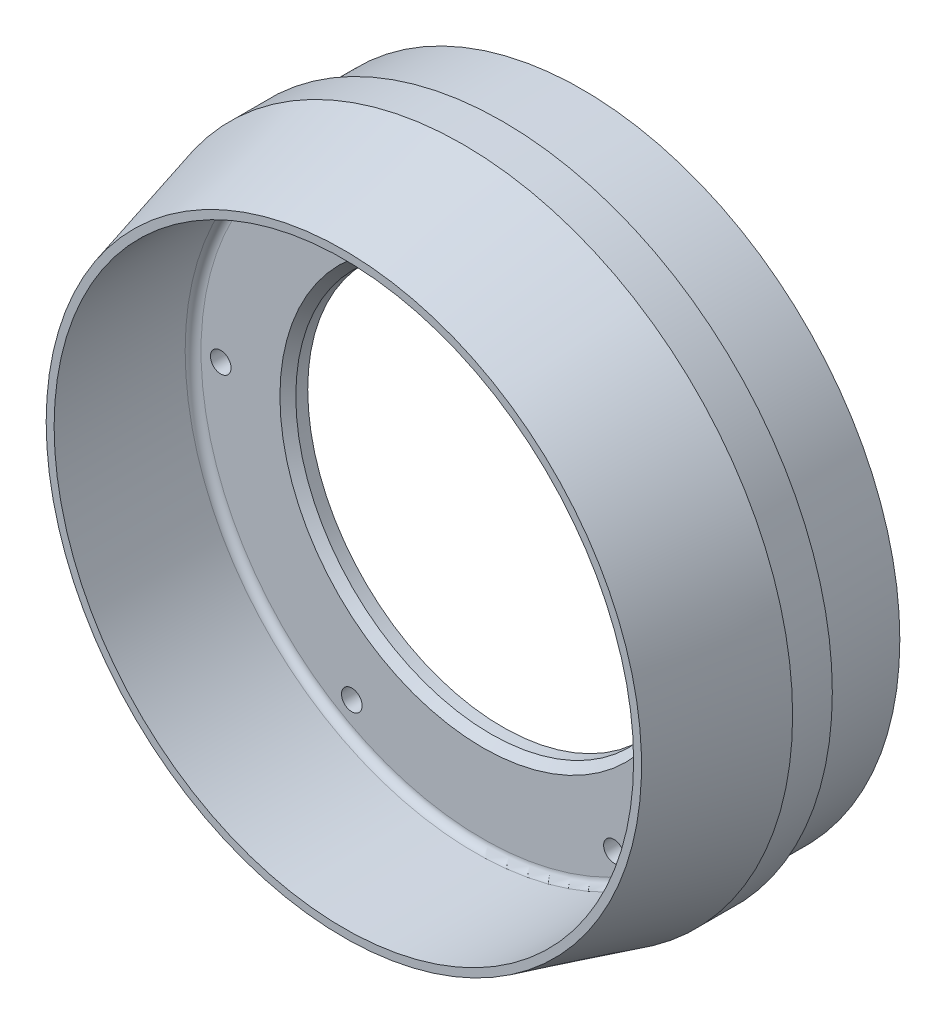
from build123d import *

# Parameters (mm, degrees)
CHAMFER1_SIZE              = 2
CHAMFER2_SIZE              = 2
F_6_0_204_DIAMETER_HOLE1_D = 5.1816
CIRPATTERN1_COUNT          = 6
FILLET2_R                  = 5
FILLET3_R                  = 2


with BuildPart() as part:
    # Sketch2 → Revolve1 (revolve)
    with BuildSketch(Plane(origin=(0, 0, 0), x_dir=(0, 0, -1), z_dir=(1, 0, 0)), mode=Mode.PRIVATE) as revolve1_sk:
        Polygon((-5, 83), (-35, 74.961524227), (-35, 72.961524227), (0, 72.961524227), (0, 49.1), (5, 49.1), (5, 77.5), (25, 77.5), (25, 80), (5, 80), (5, 83), align=None)
    revolve(revolve1_sk.sketch.rotate(Axis((0, 0, -77), (0, 0, 1)), 90), axis=Axis((0, 0, -77), (0, 0, 1)))

    # Chamfer1
    chamfer1_edges = [part.edges().sort_by_distance(p)[0] for p in [
        (77.5, 0, -25),
    ]]
    chamfer(chamfer1_edges, length=CHAMFER1_SIZE)

    # Chamfer2
    chamfer2_edges = [part.edges().sort_by_distance(p)[0] for p in [
        (49.1, 0, 0),
    ]]
    chamfer(chamfer2_edges, length=CHAMFER2_SIZE)

    # 6 _0.204_ Diameter Hole1 (through all)
    with Locations(Plane.XY):
        with Locations((-33, 57.15767665)):
            f_6_0_204_diameter_hole1 = Hole(F_6_0_204_DIAMETER_HOLE1_D / 2)

    # CirPattern1: 6 _0.204_ Diameter Hole1 ×6 about axis
    cirpattern1_axis = Axis((0, 0, 0), (0, 0, 1))
    for i in range(1, CIRPATTERN1_COUNT):
        add(f_6_0_204_diameter_hole1.rotate(cirpattern1_axis, i * 360 / CIRPATTERN1_COUNT), mode=Mode.SUBTRACT)

    # Fillet2
    fillet2_edges = [part.edges().sort_by_distance(p)[0] for p in [
        (77.5, 0, -5),
    ]]
    fillet(fillet2_edges, radius=FILLET2_R)

    # Fillet3
    fillet3_edges = [part.edges().sort_by_distance(p)[0] for p in [
        (72.961524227, 0, 0),
    ]]
    fillet(fillet3_edges, radius=FILLET3_R)


solid = part.part
